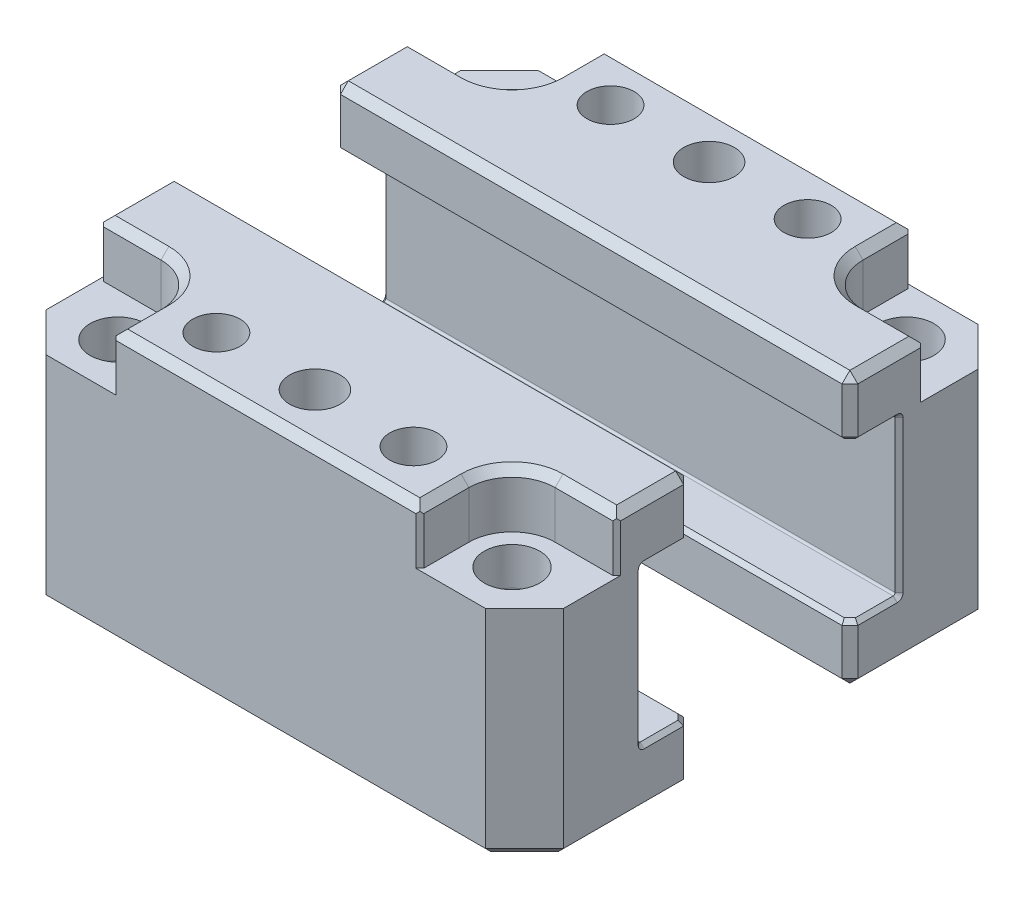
from build123d import *

# Parameters (mm, degrees)
SKETCH1_W                                        = 21.5138
SKETCH1_H                                        = 34.925
BOSS_EXTRUDE1_DEPTH                              = 33.3375
CBORE_FOR_1_4_SOCKET_HEAD_CAP_SCREW1_D           = 7.14248
CBORE_FOR_1_4_SOCKET_HEAD_CAP_SCREW1_CBORE_D     = 11.1125
CBORE_FOR_1_4_SOCKET_HEAD_CAP_SCREW1_CBORE_DEPTH = 7.112
F_5_16_18_TAPPED_HOLE1_D                         = 6.5278
F_5_16_18_TAPPED_HOLE1_DEPTH                     = 23.4442
F_5_16_18_TAPPED_HOLE1_TIP                       = 1.961148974
CHAMFER1_SIZE                                    = 5
CUT_EXTRUDE3_DEPTH                               = 7.112
SKETCH9_W                                        = 66.675
SKETCH9_H                                        = 20.0152
CUT_EXTRUDE4_DEPTH                               = 6.35
F_5_16_18_TAPPED_HOLE2_D                         = 7.1628
F_5_16_18_TAPPED_HOLE2_DEPTH                     = 22.9362
F_5_16_18_TAPPED_HOLE2_TIP                       = 2.151922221
FILLET1_R                                        = 0.254
CHAMFER2_SIZE                                    = 1.016
CHAMFER3_SIZE                                    = 0.508
CHAMFER4_SIZE                                    = 0.508


with BuildPart() as part:
    # Sketch1 → Boss-Extrude1 (new, symmetric)
    with BuildSketch(Plane(origin=(0, 0, 0), x_dir=(0, 0, -1), z_dir=(1, 0, 0))):
        with Locations((-20.9677, 17.4625)):
            Rectangle(SKETCH1_W, SKETCH1_H)
    extrude(amount=BOSS_EXTRUDE1_DEPTH, both=True)

    # CBORE for 1_4 Socket Head Cap Screw1 (through all)
    with Locations(Plane(origin=(0, 34.925, 0), x_dir=(1, 0, 0), z_dir=(0, 1, 0))):
        with Locations((-25.4, -25.4), (25.4, -25.4)):
            CounterBoreHole(CBORE_FOR_1_4_SOCKET_HEAD_CAP_SCREW1_D / 2, CBORE_FOR_1_4_SOCKET_HEAD_CAP_SCREW1_CBORE_D / 2, CBORE_FOR_1_4_SOCKET_HEAD_CAP_SCREW1_CBORE_DEPTH)

    # 5_16-18 Tapped Hole1
    with Locations(Plane(origin=(0, 34.925, 0), x_dir=(1, 0, 0), z_dir=(0, 1, 0))):
        with Locations((0, -25.4)):
            Hole(F_5_16_18_TAPPED_HOLE1_D / 2, depth=F_5_16_18_TAPPED_HOLE1_DEPTH)
            with Locations((0, 0, -(F_5_16_18_TAPPED_HOLE1_DEPTH + F_5_16_18_TAPPED_HOLE1_TIP / 2))):  # 118° drill point
                Cone(0, F_5_16_18_TAPPED_HOLE1_D / 2, F_5_16_18_TAPPED_HOLE1_TIP, mode=Mode.SUBTRACT)

    # Chamfer1
    chamfer1_edges = [part.edges().sort_by_distance(p)[0] for p in [
        (33.3375, 17.4625, 31.7246),
        (-33.3375, 17.4625, 31.7246),
    ]]
    chamfer(chamfer1_edges, length=CHAMFER1_SIZE)

    # Sketch16 → Cut-Revolve1 (revolve, cut)
    with BuildSketch(Plane.XY.offset(25.4), mode=Mode.PRIVATE) as cut_revolve1_sk:
        Polygon((-15.748, 34.925), (-15.748, 12.776309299), (-15.875, 12.7), (-15.875, 0), (-12.7, 0), (-12.7, 34.925), align=None)
    cut_revolve1 = revolve(cut_revolve1_sk.sketch.rotate(Axis((-12.7, 0, 25.4), (0, 1, 0)), 270), axis=Axis((-12.7, 0, 25.4), (0, 1, 0)), mode=Mode.SUBTRACT)

    # Mirror1: Cut-Revolve1 across plane
    add(cut_revolve1.mirror(Plane(origin=(0, 0, 0), x_dir=(0, 0, 1), z_dir=(1, 0, 0))), mode=Mode.SUBTRACT)

    # Sketch8 → Cut-Extrude3 (cut)
    with BuildSketch(Plane(origin=(0, 34.925, 0), x_dir=(1, 0, 0), z_dir=(0, 1, 0))):
        with BuildLine():
            Line((-25.4, -19.84375), (-33.3375, -19.84375))
            Line((-33.3375, -19.84375), (-33.3375, -31.7246))
            Line((-33.3375, -31.7246), (-19.84375, -31.7246))
            Line((-19.84375, -31.7246), (-19.84375, -25.4))
            ThreePointArc((-19.84375, -25.4), (-21.471137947, -21.471137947), (-25.4, -19.84375))
        make_face()
        with BuildLine():
            Line((19.84375, -31.7246), (19.84375, -25.4))
            ThreePointArc((19.84375, -25.4), (21.471137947, -21.471137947), (25.4, -19.84375))
            Line((25.4, -19.84375), (33.3375, -19.84375))
            Line((33.3375, -19.84375), (33.3375, -31.7246))
            Line((33.3375, -31.7246), (19.84375, -31.7246))
        make_face()
    extrude(amount=-CUT_EXTRUDE3_DEPTH, mode=Mode.SUBTRACT)

    # Sketch9 → Cut-Extrude4 (cut)
    with BuildSketch(Plane(origin=(0, 0, 10.2108), x_dir=(-1, 0, 0), z_dir=(0, 0, -1))):
        with Locations((0, 17.4625)):
            Rectangle(SKETCH9_W, SKETCH9_H)
    extrude(amount=-CUT_EXTRUDE4_DEPTH, mode=Mode.SUBTRACT)

    # 5_16-18 Tapped Hole2
    with Locations(Plane(origin=(0, 0, 0), x_dir=(-1, 0, 0), z_dir=(0, -1, 0))):
        with Locations((25.4, -25.4), (-25.4, -25.4)):
            Hole(F_5_16_18_TAPPED_HOLE2_D / 2, depth=F_5_16_18_TAPPED_HOLE2_DEPTH)
            with Locations((0, 0, -(F_5_16_18_TAPPED_HOLE2_DEPTH + F_5_16_18_TAPPED_HOLE2_TIP / 2))):  # 118° drill point
                Cone(0, F_5_16_18_TAPPED_HOLE2_D / 2, F_5_16_18_TAPPED_HOLE2_TIP, mode=Mode.SUBTRACT)

    # Fillet1
    fillet1_edges = [part.edges().sort_by_distance(p)[0] for p in [
        (0, 27.4701, 16.5608),
        (0, 7.4549, 16.5608),
    ]]
    fillet(fillet1_edges, radius=FILLET1_R)

    # Chamfer2
    chamfer2_edges = [part.edges().sort_by_distance(p)[0] for p in [
        (33.3375, 34.925, 15.027275),
        (-33.3375, 31.19755, 10.2108),
        (33.3375, 31.19755, 10.2108),
        (21.471137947, 34.925, 21.471137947),
        (-21.471137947, 34.925, 21.471137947),
        (33.3375, 0, 18.4677),
        (-33.3375, 0, 18.4677),
        (0, 0, 31.7246),
        (-30.8375, 0, 29.2246),
        (30.8375, 0, 29.2246),
        (-33.3375, 34.925, 15.027275),
        (-33.3375, 3.72745, 10.2108),
        (-19.84375, 34.925, 28.5623),
        (-29.36875, 34.925, 19.84375),
        (33.3375, 3.72745, 10.2108),
        (0, 34.925, 10.2108),
        (0, 0, 10.2108),
        (0, 34.925, 31.7246),
        (19.84375, 34.925, 28.5623),
        (29.36875, 34.925, 19.84375),
    ]]
    chamfer(chamfer2_edges, length=CHAMFER2_SIZE)

    # Chamfer3
    chamfer3_edges = [part.edges().sort_by_distance(p)[0] for p in [
        (-33.3375, 17.4625, 16.5608),
        (33.3375, 17.4625, 16.5608),
        (33.3375, 7.4549, 13.7668),
        (-33.3375, 7.4549, 13.7668),
        (-33.3375, 27.4701, 13.7668),
        (33.3375, 27.4701, 13.7668),
        (-33.3375, 7.529294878, 16.486405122),
        (33.3375, 7.529294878, 16.486405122),
        (33.3375, 27.395705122, 16.486405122),
        (-33.3375, 27.395705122, 16.486405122),
        (0, 7.4549, 10.2108),
        (-32.8295, 7.4549, 10.7188),
        (32.8295, 7.4549, 10.7188),
        (0, 27.4701, 10.2108),
        (32.8295, 27.4701, 10.7188),
        (-32.8295, 27.4701, 10.7188),
        (-33.3375, 30.861, 19.84375),
        (-19.84375, 30.861, 31.7246),
        (19.84375, 30.861, 31.7246),
        (33.3375, 30.861, 19.84375),
    ]]
    chamfer(chamfer3_edges, length=CHAMFER3_SIZE)

    # Chamfer4
    chamfer4_edges = [part.edges().sort_by_distance(p)[0] for p in [
        (-12.7, 0, 28.575),
        (12.7, 0, 28.575),
    ]]
    chamfer(chamfer4_edges, length=CHAMFER4_SIZE)


with BuildPart() as body_2:
    # Mirror2: mirrored copy
    add(part.part.mirror(Plane.XY))


solid = Compound([part.part, body_2.part])
